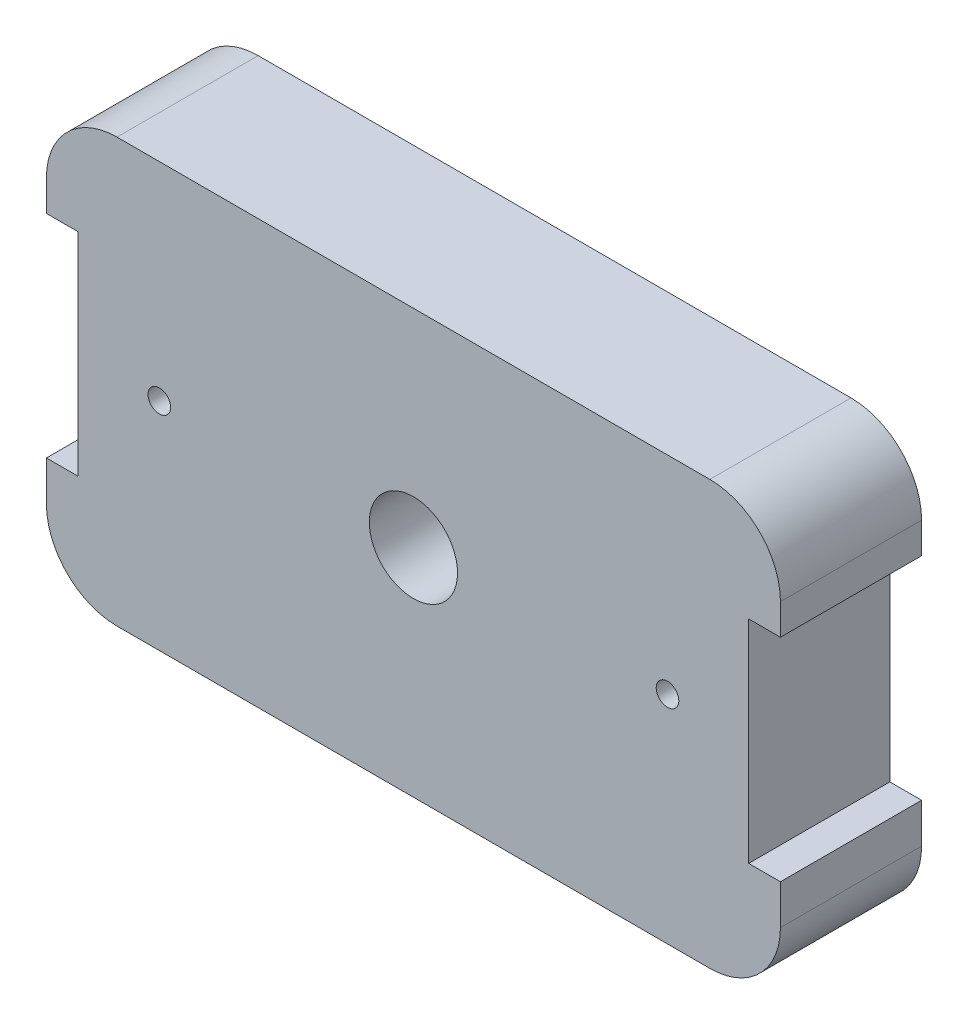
from build123d import *

# Parameters (mm, degrees)
SKETCH1_R           = 1.6
SKETCH1_R_2         = 6.25
BOSS_EXTRUDE1_DEPTH = 20
FILLET1_R           = 10


with BuildPart() as part:
    # Sketch1 → Boss-Extrude1 (new body)
    with BuildSketch(Plane.XY):
        Polygon((-47.5, 15), (-52, 15), (-52, 29.367392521), (52, 29.367392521), (52, 15), (47.5, 15), (47.5, -15), (52, -15), (52, -30.632607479), (-52, -30.632607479), (-52, -15), (-47.5, -15), align=None)
        with Locations((36, 0)):
            Circle(SKETCH1_R, mode=Mode.SUBTRACT)
        with Locations((-36, 0)):
            Circle(SKETCH1_R, mode=Mode.SUBTRACT)
        Circle(SKETCH1_R_2, mode=Mode.SUBTRACT)
    extrude(amount=BOSS_EXTRUDE1_DEPTH)

    # Fillet1
    fillet1_edges = [part.edges().sort_by_distance(p)[0] for p in [
        (52, -30.632607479, 10),
        (-52, -30.632607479, 10),
        (-52, 29.367392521, 10),
        (52, 29.367392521, 10),
    ]]
    fillet(fillet1_edges, radius=FILLET1_R)


solid = part.part
